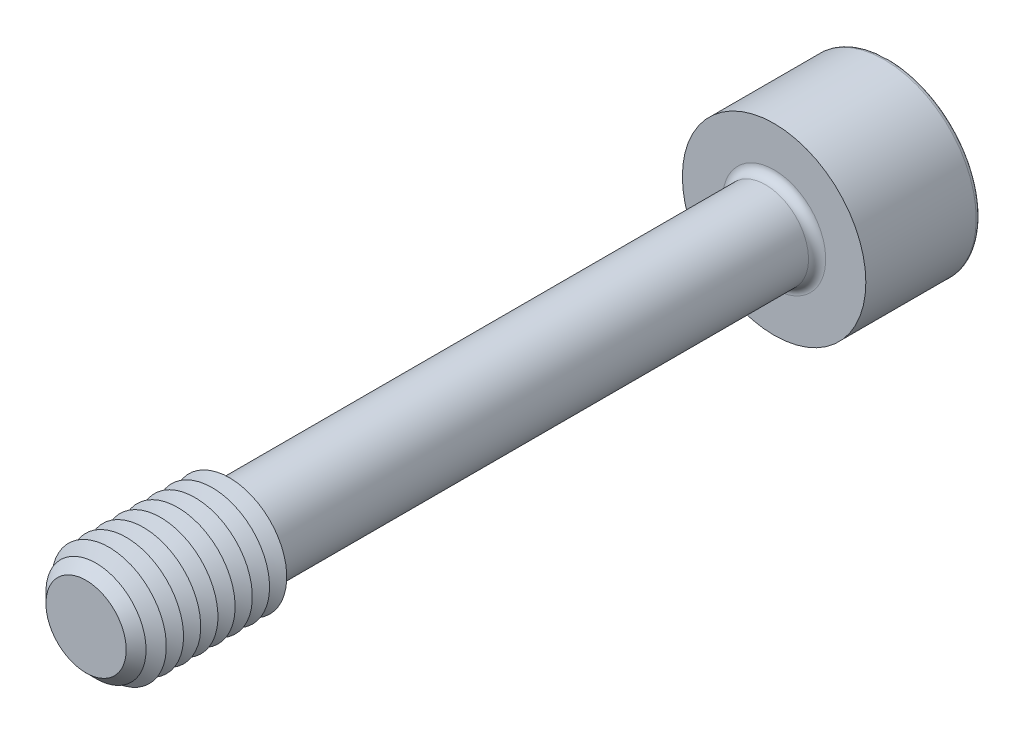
ISO-10303-21;
HEADER;
FILE_DESCRIPTION(('STEP AP214'),'2;1');
FILE_NAME('part.step','',(''),(''),'','','');
FILE_SCHEMA(('AUTOMOTIVE_DESIGN { 1 0 10303 214 1 1 1 1 }'));
ENDSEC;
DATA;
#1=APPLICATION_CONTEXT('core data for automotive mechanical design processes');
#2=APPLICATION_PROTOCOL_DEFINITION('international standard','automotive_design',2000,#1);
#3=PRODUCT_CONTEXT('',#1,'mechanical');
#4=PRODUCT('Part','Part','',(#3));
#5=PRODUCT_RELATED_PRODUCT_CATEGORY('part','',(#4));
#6=PRODUCT_DEFINITION_FORMATION('','',#4);
#7=PRODUCT_DEFINITION_CONTEXT('part definition',#1,'design');
#8=PRODUCT_DEFINITION('design','',#6,#7);
#9=PRODUCT_DEFINITION_SHAPE('','',#8);
#10=(LENGTH_UNIT() NAMED_UNIT(*) SI_UNIT(.MILLI.,.METRE.));
#11=(NAMED_UNIT(*) PLANE_ANGLE_UNIT() SI_UNIT($,.RADIAN.));
#12=(NAMED_UNIT(*) SI_UNIT($,.STERADIAN.) SOLID_ANGLE_UNIT());
#13=UNCERTAINTY_MEASURE_WITH_UNIT(LENGTH_MEASURE(1.E-05),#10,'distance_accuracy_value','');
#14=(GEOMETRIC_REPRESENTATION_CONTEXT(3) GLOBAL_UNCERTAINTY_ASSIGNED_CONTEXT((#13)) GLOBAL_UNIT_ASSIGNED_CONTEXT((#10,
#11,#12)) REPRESENTATION_CONTEXT('',''));
#15=CARTESIAN_POINT('',(0.,0.,0.));
#16=DIRECTION('',(0.,0.,1.));
#17=DIRECTION('',(1.,0.,0.));
#18=AXIS2_PLACEMENT_3D('',#15,#16,#17);
#19=CARTESIAN_POINT('',(-2.3094010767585,-4.,-32.));
#20=DIRECTION('',(0.,0.,1.));
#21=DIRECTION('',(1.,0.,0.));
#22=AXIS2_PLACEMENT_3D('',#19,#20,#21);
#23=PLANE('',#22);
#24=DIRECTION('',(1.,0.,0.));
#25=VECTOR('',#24,1.);
#26=CARTESIAN_POINT('',(-2.3094010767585,-4.,-32.));
#27=LINE('',#26,#25);
#28=CARTESIAN_POINT('',(0.,-4.,-32.));
#29=VERTEX_POINT('',#28);
#30=CARTESIAN_POINT('',(2.3094010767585,-4.,-32.));
#31=VERTEX_POINT('',#30);
#32=EDGE_CURVE('E762',#29,#31,#27,.T.);
#33=ORIENTED_EDGE('',*,*,#32,.F.);
#34=CARTESIAN_POINT('',(0.,0.,-32.));
#35=DIRECTION('',(0.,0.,1.));
#36=DIRECTION('',(0.,-1.,0.));
#37=AXIS2_PLACEMENT_3D('',#34,#35,#36);
#38=CIRCLE('',#37,4.);
#39=CARTESIAN_POINT('',(3.46410161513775,-2.,-32.));
#40=VERTEX_POINT('',#39);
#41=EDGE_CURVE('E53',#29,#40,#38,.T.);
#42=ORIENTED_EDGE('',*,*,#41,.T.);
#43=DIRECTION('',(0.5,0.866025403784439,0.));
#44=VECTOR('',#43,1.);
#45=CARTESIAN_POINT('',(2.3094010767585,-4.,-32.));
#46=LINE('',#45,#44);
#47=EDGE_CURVE('E747',#31,#40,#46,.T.);
#48=ORIENTED_EDGE('',*,*,#47,.F.);
#49=EDGE_LOOP('',(#33,#42,#48));
#50=FACE_BOUND('',#49,.T.);
#51=ADVANCED_FACE('F41',(#50),#23,.F.);
#52=CARTESIAN_POINT('',(4.618802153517,0.,-32.));
#53=VERTEX_POINT('',#52);
#54=EDGE_CURVE('E759',#40,#53,#46,.T.);
#55=ORIENTED_EDGE('',*,*,#54,.F.);
#56=CARTESIAN_POINT('',(3.46410161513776,2.,-32.));
#57=VERTEX_POINT('',#56);
#58=EDGE_CURVE('E11',#40,#57,#38,.T.);
#59=ORIENTED_EDGE('',*,*,#58,.T.);
#60=DIRECTION('',(-0.5,0.866025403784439,0.));
#61=VECTOR('',#60,1.);
#62=CARTESIAN_POINT('',(4.618802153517,0.,-32.));
#63=LINE('',#62,#61);
#64=EDGE_CURVE('E746',#53,#57,#63,.T.);
#65=ORIENTED_EDGE('',*,*,#64,.F.);
#66=EDGE_LOOP('',(#55,#59,#65));
#67=FACE_BOUND('',#66,.T.);
#68=ADVANCED_FACE('F133',(#67),#23,.F.);
#69=CARTESIAN_POINT('',(2.3094010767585,4.,-32.));
#70=VERTEX_POINT('',#69);
#71=EDGE_CURVE('E741',#57,#70,#63,.T.);
#72=ORIENTED_EDGE('',*,*,#71,.F.);
#73=CARTESIAN_POINT('',(0.,4.,-32.));
#74=VERTEX_POINT('',#73);
#75=EDGE_CURVE('E51',#57,#74,#38,.T.);
#76=ORIENTED_EDGE('',*,*,#75,.T.);
#77=DIRECTION('',(-1.,0.,0.));
#78=VECTOR('',#77,1.);
#79=CARTESIAN_POINT('',(2.3094010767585,4.,-32.));
#80=LINE('',#79,#78);
#81=EDGE_CURVE('E177',#70,#74,#80,.T.);
#82=ORIENTED_EDGE('',*,*,#81,.F.);
#83=EDGE_LOOP('',(#72,#76,#82));
#84=FACE_BOUND('',#83,.T.);
#85=ADVANCED_FACE('F139',(#84),#23,.F.);
#86=CARTESIAN_POINT('',(-2.3094010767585,4.,-32.));
#87=VERTEX_POINT('',#86);
#88=EDGE_CURVE('E752',#74,#87,#80,.T.);
#89=ORIENTED_EDGE('',*,*,#88,.F.);
#90=CARTESIAN_POINT('',(-3.46410161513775,2.,-32.));
#91=VERTEX_POINT('',#90);
#92=EDGE_CURVE('E265',#74,#91,#38,.T.);
#93=ORIENTED_EDGE('',*,*,#92,.T.);
#94=DIRECTION('',(-0.500000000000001,-0.866025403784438,0.));
#95=VECTOR('',#94,1.);
#96=CARTESIAN_POINT('',(-2.3094010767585,4.,-32.));
#97=LINE('',#96,#95);
#98=EDGE_CURVE('E176',#87,#91,#97,.T.);
#99=ORIENTED_EDGE('',*,*,#98,.F.);
#100=EDGE_LOOP('',(#89,#93,#99));
#101=FACE_BOUND('',#100,.T.);
#102=ADVANCED_FACE('F157',(#101),#23,.F.);
#103=CARTESIAN_POINT('',(-4.61880215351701,0.,-32.));
#104=VERTEX_POINT('',#103);
#105=EDGE_CURVE('E170',#91,#104,#97,.T.);
#106=ORIENTED_EDGE('',*,*,#105,.F.);
#107=CARTESIAN_POINT('',(-3.46410161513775,-2.,-32.));
#108=VERTEX_POINT('',#107);
#109=EDGE_CURVE('E172',#91,#108,#38,.T.);
#110=ORIENTED_EDGE('',*,*,#109,.T.);
#111=DIRECTION('',(0.5,-0.866025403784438,0.));
#112=VECTOR('',#111,1.);
#113=CARTESIAN_POINT('',(-4.61880215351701,0.,-32.));
#114=LINE('',#113,#112);
#115=EDGE_CURVE('E174',#104,#108,#114,.T.);
#116=ORIENTED_EDGE('',*,*,#115,.F.);
#117=EDGE_LOOP('',(#106,#110,#116));
#118=FACE_BOUND('',#117,.T.);
#119=ADVANCED_FACE('F146',(#118),#23,.F.);
#120=CARTESIAN_POINT('',(0.,0.,-40.));
#121=DIRECTION('',(0.,0.,-1.));
#122=DIRECTION('',(-1.,0.,0.));
#123=AXIS2_PLACEMENT_3D('',#120,#121,#122);
#124=PLANE('',#123);
#125=CARTESIAN_POINT('',(0.,0.,-40.));
#126=DIRECTION('',(0.,0.,-1.));
#127=DIRECTION('',(-1.,0.,0.));
#128=AXIS2_PLACEMENT_3D('',#125,#126,#127);
#129=CIRCLE('',#128,7.625);
#130=CARTESIAN_POINT('',(-7.625,0.,-40.));
#131=VERTEX_POINT('',#130);
#132=EDGE_CURVE('E251',#131,#131,#129,.T.);
#133=ORIENTED_EDGE('',*,*,#132,.T.);
#134=EDGE_LOOP('',(#133));
#135=FACE_BOUND('',#134,.T.);
#136=DIRECTION('',(-0.500000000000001,-0.866025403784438,0.));
#137=VECTOR('',#136,1.);
#138=CARTESIAN_POINT('',(-2.3094010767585,4.,-40.));
#139=LINE('',#138,#137);
#140=CARTESIAN_POINT('',(-2.3094010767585,4.,-40.));
#141=VERTEX_POINT('',#140);
#142=CARTESIAN_POINT('',(-4.61880215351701,0.,-40.));
#143=VERTEX_POINT('',#142);
#144=EDGE_CURVE('E212',#141,#143,#139,.T.);
#145=ORIENTED_EDGE('',*,*,#144,.T.);
#146=DIRECTION('',(0.5,-0.866025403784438,0.));
#147=VECTOR('',#146,1.);
#148=CARTESIAN_POINT('',(-4.61880215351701,0.,-40.));
#149=LINE('',#148,#147);
#150=CARTESIAN_POINT('',(-2.3094010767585,-4.,-40.));
#151=VERTEX_POINT('',#150);
#152=EDGE_CURVE('E67',#143,#151,#149,.T.);
#153=ORIENTED_EDGE('',*,*,#152,.T.);
#154=DIRECTION('',(1.,0.,0.));
#155=VECTOR('',#154,1.);
#156=CARTESIAN_POINT('',(-2.3094010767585,-4.,-40.));
#157=LINE('',#156,#155);
#158=CARTESIAN_POINT('',(2.3094010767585,-4.,-40.));
#159=VERTEX_POINT('',#158);
#160=EDGE_CURVE('E196',#151,#159,#157,.T.);
#161=ORIENTED_EDGE('',*,*,#160,.T.);
#162=DIRECTION('',(0.5,0.866025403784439,0.));
#163=VECTOR('',#162,1.);
#164=CARTESIAN_POINT('',(2.3094010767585,-4.,-40.));
#165=LINE('',#164,#163);
#166=CARTESIAN_POINT('',(4.618802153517,0.,-40.));
#167=VERTEX_POINT('',#166);
#168=EDGE_CURVE('E200',#159,#167,#165,.T.);
#169=ORIENTED_EDGE('',*,*,#168,.T.);
#170=DIRECTION('',(-0.5,0.866025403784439,0.));
#171=VECTOR('',#170,1.);
#172=CARTESIAN_POINT('',(4.618802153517,0.,-40.));
#173=LINE('',#172,#171);
#174=CARTESIAN_POINT('',(2.3094010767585,4.,-40.));
#175=VERTEX_POINT('',#174);
#176=EDGE_CURVE('E204',#167,#175,#173,.T.);
#177=ORIENTED_EDGE('',*,*,#176,.T.);
#178=DIRECTION('',(-1.,0.,0.));
#179=VECTOR('',#178,1.);
#180=CARTESIAN_POINT('',(2.3094010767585,4.,-40.));
#181=LINE('',#180,#179);
#182=EDGE_CURVE('E208',#175,#141,#181,.T.);
#183=ORIENTED_EDGE('',*,*,#182,.T.);
#184=EDGE_LOOP('',(#145,#153,#161,#169,#177,#183));
#185=FACE_BOUND('',#184,.T.);
#186=ADVANCED_FACE('F156',(#135,#185),#124,.T.);
#187=CARTESIAN_POINT('',(0.,0.,30.));
#188=DIRECTION('',(0.,0.,-1.));
#189=DIRECTION('',(-1.,0.,0.));
#190=AXIS2_PLACEMENT_3D('',#187,#188,#189);
#191=CYLINDRICAL_SURFACE('',#190,3.75);
#192=CARTESIAN_POINT('',(0.,0.,-29.25));
#193=DIRECTION('',(0.,0.,-1.));
#194=DIRECTION('',(-1.,0.,0.));
#195=AXIS2_PLACEMENT_3D('',#192,#193,#194);
#196=CIRCLE('',#195,3.75);
#197=CARTESIAN_POINT('',(-3.75,0.,-29.25));
#198=VERTEX_POINT('',#197);
#199=EDGE_CURVE('E247',#198,#198,#196,.F.);
#200=ORIENTED_EDGE('',*,*,#199,.T.);
#201=EDGE_LOOP('',(#200));
#202=FACE_BOUND('',#201,.T.);
#203=CARTESIAN_POINT('',(0.,0.,16.778312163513));
#204=DIRECTION('',(0.,0.,-1.));
#205=DIRECTION('',(0.,1.,0.));
#206=AXIS2_PLACEMENT_3D('',#203,#204,#205);
#207=CIRCLE('',#206,3.75);
#208=CARTESIAN_POINT('',(0.,3.75,16.778312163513));
#209=VERTEX_POINT('',#208);
#210=EDGE_CURVE('E235',#209,#209,#207,.T.);
#211=ORIENTED_EDGE('',*,*,#210,.T.);
#212=EDGE_LOOP('',(#211));
#213=FACE_BOUND('',#212,.T.);
#214=ADVANCED_FACE('F163',(#202,#213),#191,.T.);
#215=CARTESIAN_POINT('',(0.,0.,16.778312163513));
#216=DIRECTION('',(0.,0.,1.));
#217=DIRECTION('',(0.,-1.,0.));
#218=AXIS2_PLACEMENT_3D('',#215,#216,#217);
#219=CONICAL_SURFACE('',#218,3.75,1.0471975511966);
#220=CARTESIAN_POINT('',(0.,0.,17.5));
#221=DIRECTION('',(0.,0.,-1.));
#222=DIRECTION('',(-1.,0.,0.));
#223=AXIS2_PLACEMENT_3D('',#220,#221,#222);
#224=CIRCLE('',#223,5.);
#225=CARTESIAN_POINT('',(-5.,0.,17.5));
#226=VERTEX_POINT('',#225);
#227=EDGE_CURVE('E269',#226,#226,#224,.T.);
#228=ORIENTED_EDGE('',*,*,#227,.T.);
#229=EDGE_LOOP('',(#228));
#230=FACE_BOUND('',#229,.T.);
#231=ORIENTED_EDGE('',*,*,#210,.F.);
#232=EDGE_LOOP('',(#231));
#233=FACE_BOUND('',#232,.T.);
#234=ADVANCED_FACE('F510',(#230,#233),#219,.T.);
#235=CARTESIAN_POINT('',(0.,0.,-30.));
#236=DIRECTION('',(0.,0.,-1.));
#237=DIRECTION('',(-1.,0.,0.));
#238=AXIS2_PLACEMENT_3D('',#235,#236,#237);
#239=PLANE('',#238);
#240=CARTESIAN_POINT('',(0.,0.,-30.));
#241=DIRECTION('',(0.,0.,-1.));
#242=DIRECTION('',(-1.,0.,0.));
#243=AXIS2_PLACEMENT_3D('',#240,#241,#242);
#244=CIRCLE('',#243,4.5);
#245=CARTESIAN_POINT('',(-4.5,0.,-30.));
#246=VERTEX_POINT('',#245);
#247=EDGE_CURVE('E243',#246,#246,#244,.T.);
#248=ORIENTED_EDGE('',*,*,#247,.T.);
#249=EDGE_LOOP('',(#248));
#250=FACE_BOUND('',#249,.T.);
#251=CARTESIAN_POINT('',(0.,0.,-30.));
#252=DIRECTION('',(0.,0.,-1.));
#253=DIRECTION('',(-1.,0.,0.));
#254=AXIS2_PLACEMENT_3D('',#251,#252,#253);
#255=CIRCLE('',#254,8.);
#256=CARTESIAN_POINT('',(-8.,0.,-30.));
#257=VERTEX_POINT('',#256);
#258=EDGE_CURVE('E231',#257,#257,#255,.T.);
#259=ORIENTED_EDGE('',*,*,#258,.F.);
#260=EDGE_LOOP('',(#259));
#261=FACE_BOUND('',#260,.T.);
#262=ADVANCED_FACE('F503',(#250,#261),#239,.F.);
#263=CARTESIAN_POINT('',(0.,0.,-40.));
#264=DIRECTION('',(0.,0.,1.));
#265=DIRECTION('',(1.,0.,0.));
#266=AXIS2_PLACEMENT_3D('',#263,#264,#265);
#267=CYLINDRICAL_SURFACE('',#266,8.);
#268=CARTESIAN_POINT('',(0.,0.,-39.625));
#269=DIRECTION('',(0.,0.,-1.));
#270=DIRECTION('',(-1.,0.,0.));
#271=AXIS2_PLACEMENT_3D('',#268,#269,#270);
#272=CIRCLE('',#271,8.);
#273=CARTESIAN_POINT('',(-8.,0.,-39.625));
#274=VERTEX_POINT('',#273);
#275=EDGE_CURVE('E254',#274,#274,#272,.F.);
#276=ORIENTED_EDGE('',*,*,#275,.T.);
#277=EDGE_LOOP('',(#276));
#278=FACE_BOUND('',#277,.T.);
#279=ORIENTED_EDGE('',*,*,#258,.T.);
#280=EDGE_LOOP('',(#279));
#281=FACE_BOUND('',#280,.T.);
#282=ADVANCED_FACE('F509',(#278,#281),#267,.T.);
#283=CARTESIAN_POINT('',(-4.61880215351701,0.,-32.));
#284=DIRECTION('',(0.866025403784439,0.5,0.));
#285=DIRECTION('',(-0.5,0.866025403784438,0.));
#286=AXIS2_PLACEMENT_3D('',#283,#284,#285);
#287=PLANE('',#286);
#288=ORIENTED_EDGE('',*,*,#152,.F.);
#289=DIRECTION('',(0.,0.,-1.));
#290=VECTOR('',#289,1.);
#291=CARTESIAN_POINT('',(-4.61880215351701,0.,-32.));
#292=LINE('',#291,#290);
#293=EDGE_CURVE('E186',#104,#143,#292,.T.);
#294=ORIENTED_EDGE('',*,*,#293,.F.);
#295=ORIENTED_EDGE('',*,*,#115,.T.);
#296=CARTESIAN_POINT('',(-2.3094010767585,-4.,-32.));
#297=VERTEX_POINT('',#296);
#298=EDGE_CURVE('E215',#108,#297,#114,.T.);
#299=ORIENTED_EDGE('',*,*,#298,.T.);
#300=DIRECTION('',(0.,0.,-1.));
#301=VECTOR('',#300,1.);
#302=CARTESIAN_POINT('',(-2.3094010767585,-4.,-32.));
#303=LINE('',#302,#301);
#304=EDGE_CURVE('E228',#297,#151,#303,.T.);
#305=ORIENTED_EDGE('',*,*,#304,.T.);
#306=EDGE_LOOP('',(#288,#294,#295,#299,#305));
#307=FACE_BOUND('',#306,.T.);
#308=ADVANCED_FACE('F521',(#307),#287,.T.);
#309=CARTESIAN_POINT('',(-2.3094010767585,-4.,-32.));
#310=DIRECTION('',(0.,1.,0.));
#311=DIRECTION('',(-1.,0.,0.));
#312=AXIS2_PLACEMENT_3D('',#309,#310,#311);
#313=PLANE('',#312);
#314=ORIENTED_EDGE('',*,*,#160,.F.);
#315=ORIENTED_EDGE('',*,*,#304,.F.);
#316=EDGE_CURVE('E760',#297,#29,#27,.T.);
#317=ORIENTED_EDGE('',*,*,#316,.T.);
#318=ORIENTED_EDGE('',*,*,#32,.T.);
#319=DIRECTION('',(0.,0.,-1.));
#320=VECTOR('',#319,1.);
#321=CARTESIAN_POINT('',(2.3094010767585,-4.,-32.));
#322=LINE('',#321,#320);
#323=EDGE_CURVE('E225',#31,#159,#322,.T.);
#324=ORIENTED_EDGE('',*,*,#323,.T.);
#325=EDGE_LOOP('',(#314,#315,#317,#318,#324));
#326=FACE_BOUND('',#325,.T.);
#327=ADVANCED_FACE('F537',(#326),#313,.T.);
#328=CARTESIAN_POINT('',(2.3094010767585,-4.,-32.));
#329=DIRECTION('',(-0.866025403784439,0.5,0.));
#330=DIRECTION('',(-0.5,-0.866025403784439,0.));
#331=AXIS2_PLACEMENT_3D('',#328,#329,#330);
#332=PLANE('',#331);
#333=ORIENTED_EDGE('',*,*,#168,.F.);
#334=ORIENTED_EDGE('',*,*,#323,.F.);
#335=ORIENTED_EDGE('',*,*,#47,.T.);
#336=ORIENTED_EDGE('',*,*,#54,.T.);
#337=DIRECTION('',(0.,0.,-1.));
#338=VECTOR('',#337,1.);
#339=CARTESIAN_POINT('',(4.618802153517,0.,-32.));
#340=LINE('',#339,#338);
#341=EDGE_CURVE('E222',#53,#167,#340,.T.);
#342=ORIENTED_EDGE('',*,*,#341,.T.);
#343=EDGE_LOOP('',(#333,#334,#335,#336,#342));
#344=FACE_BOUND('',#343,.T.);
#345=ADVANCED_FACE('F547',(#344),#332,.T.);
#346=CARTESIAN_POINT('',(4.618802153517,0.,-32.));
#347=DIRECTION('',(-0.866025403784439,-0.5,0.));
#348=DIRECTION('',(0.5,-0.866025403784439,0.));
#349=AXIS2_PLACEMENT_3D('',#346,#347,#348);
#350=PLANE('',#349);
#351=ORIENTED_EDGE('',*,*,#176,.F.);
#352=ORIENTED_EDGE('',*,*,#341,.F.);
#353=ORIENTED_EDGE('',*,*,#64,.T.);
#354=ORIENTED_EDGE('',*,*,#71,.T.);
#355=DIRECTION('',(0.,0.,-1.));
#356=VECTOR('',#355,1.);
#357=CARTESIAN_POINT('',(2.3094010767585,4.,-32.));
#358=LINE('',#357,#356);
#359=EDGE_CURVE('E219',#70,#175,#358,.T.);
#360=ORIENTED_EDGE('',*,*,#359,.T.);
#361=EDGE_LOOP('',(#351,#352,#353,#354,#360));
#362=FACE_BOUND('',#361,.T.);
#363=ADVANCED_FACE('F557',(#362),#350,.T.);
#364=CARTESIAN_POINT('',(2.3094010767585,4.,-32.));
#365=DIRECTION('',(0.,-1.,0.));
#366=DIRECTION('',(0.,0.,-1.));
#367=AXIS2_PLACEMENT_3D('',#364,#365,#366);
#368=PLANE('',#367);
#369=ORIENTED_EDGE('',*,*,#182,.F.);
#370=ORIENTED_EDGE('',*,*,#359,.F.);
#371=ORIENTED_EDGE('',*,*,#81,.T.);
#372=ORIENTED_EDGE('',*,*,#88,.T.);
#373=DIRECTION('',(0.,0.,-1.));
#374=VECTOR('',#373,1.);
#375=CARTESIAN_POINT('',(-2.3094010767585,4.,-32.));
#376=LINE('',#375,#374);
#377=EDGE_CURVE('E182',#87,#141,#376,.T.);
#378=ORIENTED_EDGE('',*,*,#377,.T.);
#379=EDGE_LOOP('',(#369,#370,#371,#372,#378));
#380=FACE_BOUND('',#379,.T.);
#381=ADVANCED_FACE('F152',(#380),#368,.T.);
#382=CARTESIAN_POINT('',(-2.3094010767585,4.,-32.));
#383=DIRECTION('',(0.866025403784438,-0.500000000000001,0.));
#384=DIRECTION('',(0.500000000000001,0.866025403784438,0.));
#385=AXIS2_PLACEMENT_3D('',#382,#383,#384);
#386=PLANE('',#385);
#387=ORIENTED_EDGE('',*,*,#144,.F.);
#388=ORIENTED_EDGE('',*,*,#377,.F.);
#389=ORIENTED_EDGE('',*,*,#98,.T.);
#390=ORIENTED_EDGE('',*,*,#105,.T.);
#391=ORIENTED_EDGE('',*,*,#293,.T.);
#392=EDGE_LOOP('',(#387,#388,#389,#390,#391));
#393=FACE_BOUND('',#392,.T.);
#394=ADVANCED_FACE('F144',(#393),#386,.T.);
#395=ORIENTED_EDGE('',*,*,#298,.F.);
#396=EDGE_CURVE('E257',#108,#29,#38,.T.);
#397=ORIENTED_EDGE('',*,*,#396,.T.);
#398=ORIENTED_EDGE('',*,*,#316,.F.);
#399=EDGE_LOOP('',(#395,#397,#398));
#400=FACE_BOUND('',#399,.T.);
#401=ADVANCED_FACE('F135',(#400),#23,.F.);
#402=CARTESIAN_POINT('',(0.,0.,-29.25));
#403=DIRECTION('',(0.,0.,-1.));
#404=DIRECTION('',(-1.,0.,0.));
#405=AXIS2_PLACEMENT_3D('',#402,#403,#404);
#406=TOROIDAL_SURFACE('',#405,4.5,0.75);
#407=ORIENTED_EDGE('',*,*,#199,.F.);
#408=EDGE_LOOP('',(#407));
#409=FACE_BOUND('',#408,.T.);
#410=ORIENTED_EDGE('',*,*,#247,.F.);
#411=EDGE_LOOP('',(#410));
#412=FACE_BOUND('',#411,.T.);
#413=ADVANCED_FACE('F129',(#409,#412),#406,.F.);
#414=CARTESIAN_POINT('',(0.,0.,-39.625));
#415=DIRECTION('',(0.,0.,-1.));
#416=DIRECTION('',(-1.,0.,0.));
#417=AXIS2_PLACEMENT_3D('',#414,#415,#416);
#418=TOROIDAL_SURFACE('',#417,7.625,0.375);
#419=ORIENTED_EDGE('',*,*,#275,.F.);
#420=EDGE_LOOP('',(#419));
#421=FACE_BOUND('',#420,.T.);
#422=ORIENTED_EDGE('',*,*,#132,.F.);
#423=EDGE_LOOP('',(#422));
#424=FACE_BOUND('',#423,.T.);
#425=ADVANCED_FACE('F43',(#421,#424),#418,.T.);
#426=CARTESIAN_POINT('',(0.,0.,-29.6905989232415));
#427=DIRECTION('',(0.,0.,-1.));
#428=DIRECTION('',(0.,1.,0.));
#429=AXIS2_PLACEMENT_3D('',#426,#427,#428);
#430=CONICAL_SURFACE('',#429,0.,1.0471975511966);
#431=ORIENTED_EDGE('',*,*,#41,.F.);
#432=ORIENTED_EDGE('',*,*,#396,.F.);
#433=ORIENTED_EDGE('',*,*,#109,.F.);
#434=ORIENTED_EDGE('',*,*,#92,.F.);
#435=ORIENTED_EDGE('',*,*,#75,.F.);
#436=ORIENTED_EDGE('',*,*,#58,.F.);
#437=EDGE_LOOP('',(#431,#432,#433,#434,#435,#436));
#438=FACE_BOUND('',#437,.T.);
#439=CARTESIAN_POINT('',(0.,0.,-29.6905989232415));
#440=VERTEX_POINT('',#439);
#441=VERTEX_LOOP('',#440);
#442=FACE_BOUND('',#441,.T.);
#443=ADVANCED_FACE('F118',(#438,#442),#430,.F.);
#444=CARTESIAN_POINT('',(0.,0.,18.25));
#445=DIRECTION('',(0.,0.,-1.));
#446=DIRECTION('',(-1.,0.,0.));
#447=AXIS2_PLACEMENT_3D('',#444,#445,#446);
#448=CONICAL_SURFACE('',#447,3.70096189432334,1.0471975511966);
#449=ORIENTED_EDGE('',*,*,#227,.F.);
#450=EDGE_LOOP('',(#449));
#451=FACE_BOUND('',#450,.T.);
#452=CARTESIAN_POINT('',(0.,0.,18.25));
#453=DIRECTION('',(0.,0.,-1.));
#454=DIRECTION('',(-1.,0.,0.));
#455=AXIS2_PLACEMENT_3D('',#452,#453,#454);
#456=CIRCLE('',#455,3.70096189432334);
#457=CARTESIAN_POINT('',(-3.70096189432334,0.,18.25));
#458=VERTEX_POINT('',#457);
#459=EDGE_CURVE('E275',#458,#458,#456,.T.);
#460=ORIENTED_EDGE('',*,*,#459,.T.);
#461=EDGE_LOOP('',(#460));
#462=FACE_BOUND('',#461,.T.);
#463=ADVANCED_FACE('F120',(#451,#462),#448,.T.);
#464=CARTESIAN_POINT('',(0.,0.,19.));
#465=DIRECTION('',(0.,0.,1.));
#466=DIRECTION('',(1.,0.,0.));
#467=AXIS2_PLACEMENT_3D('',#464,#465,#466);
#468=CONICAL_SURFACE('',#467,5.,1.0471975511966);
#469=ORIENTED_EDGE('',*,*,#459,.F.);
#470=EDGE_LOOP('',(#469));
#471=FACE_BOUND('',#470,.T.);
#472=CARTESIAN_POINT('',(0.,0.,19.));
#473=DIRECTION('',(0.,0.,-1.));
#474=DIRECTION('',(-1.,0.,0.));
#475=AXIS2_PLACEMENT_3D('',#472,#473,#474);
#476=CIRCLE('',#475,5.);
#477=CARTESIAN_POINT('',(-5.,0.,19.));
#478=VERTEX_POINT('',#477);
#479=EDGE_CURVE('E282',#478,#478,#476,.T.);
#480=ORIENTED_EDGE('',*,*,#479,.T.);
#481=EDGE_LOOP('',(#480));
#482=FACE_BOUND('',#481,.T.);
#483=ADVANCED_FACE('F126',(#471,#482),#468,.T.);
#484=CARTESIAN_POINT('',(0.,0.,19.75));
#485=DIRECTION('',(0.,0.,-1.));
#486=DIRECTION('',(-1.,0.,0.));
#487=AXIS2_PLACEMENT_3D('',#484,#485,#486);
#488=CONICAL_SURFACE('',#487,3.70096189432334,1.0471975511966);
#489=ORIENTED_EDGE('',*,*,#479,.F.);
#490=EDGE_LOOP('',(#489));
#491=FACE_BOUND('',#490,.T.);
#492=CARTESIAN_POINT('',(0.,0.,19.75));
#493=DIRECTION('',(0.,0.,-1.));
#494=DIRECTION('',(-1.,0.,0.));
#495=AXIS2_PLACEMENT_3D('',#492,#493,#494);
#496=CIRCLE('',#495,3.70096189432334);
#497=CARTESIAN_POINT('',(-3.70096189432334,0.,19.75));
#498=VERTEX_POINT('',#497);
#499=EDGE_CURVE('E288',#498,#498,#496,.T.);
#500=ORIENTED_EDGE('',*,*,#499,.T.);
#501=EDGE_LOOP('',(#500));
#502=FACE_BOUND('',#501,.T.);
#503=ADVANCED_FACE('F397',(#491,#502),#488,.T.);
#504=CARTESIAN_POINT('',(0.,0.,20.5));
#505=DIRECTION('',(0.,0.,1.));
#506=DIRECTION('',(1.,0.,0.));
#507=AXIS2_PLACEMENT_3D('',#504,#505,#506);
#508=CONICAL_SURFACE('',#507,5.,1.0471975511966);
#509=ORIENTED_EDGE('',*,*,#499,.F.);
#510=EDGE_LOOP('',(#509));
#511=FACE_BOUND('',#510,.T.);
#512=CARTESIAN_POINT('',(0.,0.,20.5));
#513=DIRECTION('',(0.,0.,-1.));
#514=DIRECTION('',(-1.,0.,0.));
#515=AXIS2_PLACEMENT_3D('',#512,#513,#514);
#516=CIRCLE('',#515,5.);
#517=CARTESIAN_POINT('',(-5.,0.,20.5));
#518=VERTEX_POINT('',#517);
#519=EDGE_CURVE('E292',#518,#518,#516,.T.);
#520=ORIENTED_EDGE('',*,*,#519,.T.);
#521=EDGE_LOOP('',(#520));
#522=FACE_BOUND('',#521,.T.);
#523=ADVANCED_FACE('F393',(#511,#522),#508,.T.);
#524=CARTESIAN_POINT('',(0.,0.,21.25));
#525=DIRECTION('',(0.,0.,-1.));
#526=DIRECTION('',(-1.,0.,0.));
#527=AXIS2_PLACEMENT_3D('',#524,#525,#526);
#528=CONICAL_SURFACE('',#527,3.70096189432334,1.0471975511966);
#529=ORIENTED_EDGE('',*,*,#519,.F.);
#530=EDGE_LOOP('',(#529));
#531=FACE_BOUND('',#530,.T.);
#532=CARTESIAN_POINT('',(0.,0.,21.25));
#533=DIRECTION('',(0.,0.,-1.));
#534=DIRECTION('',(-1.,0.,0.));
#535=AXIS2_PLACEMENT_3D('',#532,#533,#534);
#536=CIRCLE('',#535,3.70096189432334);
#537=CARTESIAN_POINT('',(-3.70096189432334,0.,21.25));
#538=VERTEX_POINT('',#537);
#539=EDGE_CURVE('E296',#538,#538,#536,.T.);
#540=ORIENTED_EDGE('',*,*,#539,.T.);
#541=EDGE_LOOP('',(#540));
#542=FACE_BOUND('',#541,.T.);
#543=ADVANCED_FACE('F389',(#531,#542),#528,.T.);
#544=CARTESIAN_POINT('',(0.,0.,22.));
#545=DIRECTION('',(0.,0.,1.));
#546=DIRECTION('',(1.,0.,0.));
#547=AXIS2_PLACEMENT_3D('',#544,#545,#546);
#548=CONICAL_SURFACE('',#547,5.,1.0471975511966);
#549=ORIENTED_EDGE('',*,*,#539,.F.);
#550=EDGE_LOOP('',(#549));
#551=FACE_BOUND('',#550,.T.);
#552=CARTESIAN_POINT('',(0.,0.,22.));
#553=DIRECTION('',(0.,0.,-1.));
#554=DIRECTION('',(-1.,0.,0.));
#555=AXIS2_PLACEMENT_3D('',#552,#553,#554);
#556=CIRCLE('',#555,5.);
#557=CARTESIAN_POINT('',(-5.,0.,22.));
#558=VERTEX_POINT('',#557);
#559=EDGE_CURVE('E300',#558,#558,#556,.T.);
#560=ORIENTED_EDGE('',*,*,#559,.T.);
#561=EDGE_LOOP('',(#560));
#562=FACE_BOUND('',#561,.T.);
#563=ADVANCED_FACE('F385',(#551,#562),#548,.T.);
#564=CARTESIAN_POINT('',(0.,0.,22.75));
#565=DIRECTION('',(0.,0.,-1.));
#566=DIRECTION('',(-1.,0.,0.));
#567=AXIS2_PLACEMENT_3D('',#564,#565,#566);
#568=CONICAL_SURFACE('',#567,3.70096189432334,1.0471975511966);
#569=ORIENTED_EDGE('',*,*,#559,.F.);
#570=EDGE_LOOP('',(#569));
#571=FACE_BOUND('',#570,.T.);
#572=CARTESIAN_POINT('',(0.,0.,22.75));
#573=DIRECTION('',(0.,0.,-1.));
#574=DIRECTION('',(-1.,0.,0.));
#575=AXIS2_PLACEMENT_3D('',#572,#573,#574);
#576=CIRCLE('',#575,3.70096189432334);
#577=CARTESIAN_POINT('',(-3.70096189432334,0.,22.75));
#578=VERTEX_POINT('',#577);
#579=EDGE_CURVE('E303',#578,#578,#576,.T.);
#580=ORIENTED_EDGE('',*,*,#579,.T.);
#581=EDGE_LOOP('',(#580));
#582=FACE_BOUND('',#581,.T.);
#583=ADVANCED_FACE('F381',(#571,#582),#568,.T.);
#584=CARTESIAN_POINT('',(0.,0.,23.5));
#585=DIRECTION('',(0.,0.,1.));
#586=DIRECTION('',(1.,0.,0.));
#587=AXIS2_PLACEMENT_3D('',#584,#585,#586);
#588=CONICAL_SURFACE('',#587,5.,1.0471975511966);
#589=ORIENTED_EDGE('',*,*,#579,.F.);
#590=EDGE_LOOP('',(#589));
#591=FACE_BOUND('',#590,.T.);
#592=CARTESIAN_POINT('',(0.,0.,23.5));
#593=DIRECTION('',(0.,0.,-1.));
#594=DIRECTION('',(-1.,0.,0.));
#595=AXIS2_PLACEMENT_3D('',#592,#593,#594);
#596=CIRCLE('',#595,5.);
#597=CARTESIAN_POINT('',(-5.,0.,23.5));
#598=VERTEX_POINT('',#597);
#599=EDGE_CURVE('E306',#598,#598,#596,.T.);
#600=ORIENTED_EDGE('',*,*,#599,.T.);
#601=EDGE_LOOP('',(#600));
#602=FACE_BOUND('',#601,.T.);
#603=ADVANCED_FACE('F377',(#591,#602),#588,.T.);
#604=CARTESIAN_POINT('',(0.,0.,24.25));
#605=DIRECTION('',(0.,0.,-1.));
#606=DIRECTION('',(-1.,0.,0.));
#607=AXIS2_PLACEMENT_3D('',#604,#605,#606);
#608=CONICAL_SURFACE('',#607,3.70096189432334,1.0471975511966);
#609=ORIENTED_EDGE('',*,*,#599,.F.);
#610=EDGE_LOOP('',(#609));
#611=FACE_BOUND('',#610,.T.);
#612=CARTESIAN_POINT('',(0.,0.,24.25));
#613=DIRECTION('',(0.,0.,-1.));
#614=DIRECTION('',(-1.,0.,0.));
#615=AXIS2_PLACEMENT_3D('',#612,#613,#614);
#616=CIRCLE('',#615,3.70096189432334);
#617=CARTESIAN_POINT('',(-3.70096189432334,0.,24.25));
#618=VERTEX_POINT('',#617);
#619=EDGE_CURVE('E310',#618,#618,#616,.T.);
#620=ORIENTED_EDGE('',*,*,#619,.T.);
#621=EDGE_LOOP('',(#620));
#622=FACE_BOUND('',#621,.T.);
#623=ADVANCED_FACE('F373',(#611,#622),#608,.T.);
#624=CARTESIAN_POINT('',(0.,0.,25.));
#625=DIRECTION('',(0.,0.,1.));
#626=DIRECTION('',(1.,0.,0.));
#627=AXIS2_PLACEMENT_3D('',#624,#625,#626);
#628=CONICAL_SURFACE('',#627,5.,1.0471975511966);
#629=ORIENTED_EDGE('',*,*,#619,.F.);
#630=EDGE_LOOP('',(#629));
#631=FACE_BOUND('',#630,.T.);
#632=CARTESIAN_POINT('',(0.,0.,25.));
#633=DIRECTION('',(0.,0.,-1.));
#634=DIRECTION('',(-1.,0.,0.));
#635=AXIS2_PLACEMENT_3D('',#632,#633,#634);
#636=CIRCLE('',#635,5.);
#637=CARTESIAN_POINT('',(-5.,0.,25.));
#638=VERTEX_POINT('',#637);
#639=EDGE_CURVE('E314',#638,#638,#636,.T.);
#640=ORIENTED_EDGE('',*,*,#639,.T.);
#641=EDGE_LOOP('',(#640));
#642=FACE_BOUND('',#641,.T.);
#643=ADVANCED_FACE('F369',(#631,#642),#628,.T.);
#644=CARTESIAN_POINT('',(0.,0.,25.75));
#645=DIRECTION('',(0.,0.,-1.));
#646=DIRECTION('',(-1.,0.,0.));
#647=AXIS2_PLACEMENT_3D('',#644,#645,#646);
#648=CONICAL_SURFACE('',#647,3.70096189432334,1.0471975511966);
#649=ORIENTED_EDGE('',*,*,#639,.F.);
#650=EDGE_LOOP('',(#649));
#651=FACE_BOUND('',#650,.T.);
#652=CARTESIAN_POINT('',(0.,0.,25.75));
#653=DIRECTION('',(0.,0.,-1.));
#654=DIRECTION('',(-1.,0.,0.));
#655=AXIS2_PLACEMENT_3D('',#652,#653,#654);
#656=CIRCLE('',#655,3.70096189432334);
#657=CARTESIAN_POINT('',(-3.70096189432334,0.,25.75));
#658=VERTEX_POINT('',#657);
#659=EDGE_CURVE('E318',#658,#658,#656,.T.);
#660=ORIENTED_EDGE('',*,*,#659,.T.);
#661=EDGE_LOOP('',(#660));
#662=FACE_BOUND('',#661,.T.);
#663=ADVANCED_FACE('F365',(#651,#662),#648,.T.);
#664=CARTESIAN_POINT('',(0.,0.,26.5));
#665=DIRECTION('',(0.,0.,1.));
#666=DIRECTION('',(1.,0.,0.));
#667=AXIS2_PLACEMENT_3D('',#664,#665,#666);
#668=CONICAL_SURFACE('',#667,5.,1.0471975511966);
#669=ORIENTED_EDGE('',*,*,#659,.F.);
#670=EDGE_LOOP('',(#669));
#671=FACE_BOUND('',#670,.T.);
#672=CARTESIAN_POINT('',(0.,0.,26.5));
#673=DIRECTION('',(0.,0.,-1.));
#674=DIRECTION('',(-1.,0.,0.));
#675=AXIS2_PLACEMENT_3D('',#672,#673,#674);
#676=CIRCLE('',#675,5.);
#677=CARTESIAN_POINT('',(-5.,0.,26.5));
#678=VERTEX_POINT('',#677);
#679=EDGE_CURVE('E322',#678,#678,#676,.T.);
#680=ORIENTED_EDGE('',*,*,#679,.T.);
#681=EDGE_LOOP('',(#680));
#682=FACE_BOUND('',#681,.T.);
#683=ADVANCED_FACE('F361',(#671,#682),#668,.T.);
#684=CARTESIAN_POINT('',(0.,0.,27.25));
#685=DIRECTION('',(0.,0.,-1.));
#686=DIRECTION('',(-1.,0.,0.));
#687=AXIS2_PLACEMENT_3D('',#684,#685,#686);
#688=CONICAL_SURFACE('',#687,3.70096189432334,1.0471975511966);
#689=ORIENTED_EDGE('',*,*,#679,.F.);
#690=EDGE_LOOP('',(#689));
#691=FACE_BOUND('',#690,.T.);
#692=CARTESIAN_POINT('',(0.,0.,27.25));
#693=DIRECTION('',(0.,0.,-1.));
#694=DIRECTION('',(-1.,0.,0.));
#695=AXIS2_PLACEMENT_3D('',#692,#693,#694);
#696=CIRCLE('',#695,3.70096189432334);
#697=CARTESIAN_POINT('',(-3.70096189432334,0.,27.25));
#698=VERTEX_POINT('',#697);
#699=EDGE_CURVE('E326',#698,#698,#696,.T.);
#700=ORIENTED_EDGE('',*,*,#699,.T.);
#701=EDGE_LOOP('',(#700));
#702=FACE_BOUND('',#701,.T.);
#703=ADVANCED_FACE('F357',(#691,#702),#688,.T.);
#704=CARTESIAN_POINT('',(0.,0.,28.));
#705=DIRECTION('',(0.,0.,1.));
#706=DIRECTION('',(1.,0.,0.));
#707=AXIS2_PLACEMENT_3D('',#704,#705,#706);
#708=CONICAL_SURFACE('',#707,5.,1.0471975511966);
#709=ORIENTED_EDGE('',*,*,#699,.F.);
#710=EDGE_LOOP('',(#709));
#711=FACE_BOUND('',#710,.T.);
#712=CARTESIAN_POINT('',(0.,0.,28.));
#713=DIRECTION('',(0.,0.,-1.));
#714=DIRECTION('',(-1.,0.,0.));
#715=AXIS2_PLACEMENT_3D('',#712,#713,#714);
#716=CIRCLE('',#715,5.);
#717=CARTESIAN_POINT('',(-5.,0.,28.));
#718=VERTEX_POINT('',#717);
#719=EDGE_CURVE('E329',#718,#718,#716,.T.);
#720=ORIENTED_EDGE('',*,*,#719,.T.);
#721=EDGE_LOOP('',(#720));
#722=FACE_BOUND('',#721,.T.);
#723=ADVANCED_FACE('F350',(#711,#722),#708,.T.);
#724=CARTESIAN_POINT('',(0.,0.,28.75));
#725=DIRECTION('',(0.,0.,-1.));
#726=DIRECTION('',(-1.,0.,0.));
#727=AXIS2_PLACEMENT_3D('',#724,#725,#726);
#728=CONICAL_SURFACE('',#727,3.70096189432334,1.0471975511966);
#729=ORIENTED_EDGE('',*,*,#719,.F.);
#730=EDGE_LOOP('',(#729));
#731=FACE_BOUND('',#730,.T.);
#732=CARTESIAN_POINT('',(0.,0.,28.75));
#733=DIRECTION('',(0.,0.,-1.));
#734=DIRECTION('',(-1.,0.,0.));
#735=AXIS2_PLACEMENT_3D('',#732,#733,#734);
#736=CIRCLE('',#735,3.70096189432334);
#737=CARTESIAN_POINT('',(-3.70096189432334,0.,28.75));
#738=VERTEX_POINT('',#737);
#739=EDGE_CURVE('E332',#738,#738,#736,.T.);
#740=ORIENTED_EDGE('',*,*,#739,.T.);
#741=EDGE_LOOP('',(#740));
#742=FACE_BOUND('',#741,.T.);
#743=ADVANCED_FACE('F336',(#731,#742),#728,.T.);
#744=CARTESIAN_POINT('',(0.,0.,29.5));
#745=DIRECTION('',(0.,0.,1.));
#746=DIRECTION('',(1.,0.,0.));
#747=AXIS2_PLACEMENT_3D('',#744,#745,#746);
#748=CONICAL_SURFACE('',#747,5.,1.0471975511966);
#749=CARTESIAN_POINT('',(0.,0.,29.1339745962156));
#750=DIRECTION('',(0.,0.,1.));
#751=DIRECTION('',(1.,0.,0.));
#752=AXIS2_PLACEMENT_3D('',#749,#750,#751);
#753=CIRCLE('',#752,4.36602540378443);
#754=CARTESIAN_POINT('',(4.36602540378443,0.,29.1339745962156));
#755=VERTEX_POINT('',#754);
#756=EDGE_CURVE('E45',#755,#755,#753,.F.);
#757=ORIENTED_EDGE('',*,*,#756,.T.);
#758=EDGE_LOOP('',(#757));
#759=FACE_BOUND('',#758,.T.);
#760=ORIENTED_EDGE('',*,*,#739,.F.);
#761=EDGE_LOOP('',(#760));
#762=FACE_BOUND('',#761,.T.);
#763=ADVANCED_FACE('F338',(#759,#762),#748,.T.);
#764=CARTESIAN_POINT('',(0.,0.,30.));
#765=DIRECTION('',(0.,0.,1.));
#766=DIRECTION('',(1.,0.,0.));
#767=AXIS2_PLACEMENT_3D('',#764,#765,#766);
#768=PLANE('',#767);
#769=CARTESIAN_POINT('',(0.,0.,30.));
#770=DIRECTION('',(0.,0.,1.));
#771=DIRECTION('',(1.,0.,0.));
#772=AXIS2_PLACEMENT_3D('',#769,#770,#771);
#773=CIRCLE('',#772,3.49999999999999);
#774=CARTESIAN_POINT('',(3.49999999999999,0.,30.));
#775=VERTEX_POINT('',#774);
#776=EDGE_CURVE('E239',#775,#775,#773,.T.);
#777=ORIENTED_EDGE('',*,*,#776,.T.);
#778=EDGE_LOOP('',(#777));
#779=FACE_BOUND('',#778,.T.);
#780=ADVANCED_FACE('F340',(#779),#768,.T.);
#781=CARTESIAN_POINT('',(0.,0.,28.5));
#782=DIRECTION('',(0.,0.,-1.));
#783=DIRECTION('',(0.,1.,0.));
#784=AXIS2_PLACEMENT_3D('',#781,#782,#783);
#785=CONICAL_SURFACE('',#784,5.,0.785398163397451);
#786=ORIENTED_EDGE('',*,*,#756,.F.);
#787=EDGE_LOOP('',(#786));
#788=FACE_BOUND('',#787,.T.);
#789=ORIENTED_EDGE('',*,*,#776,.F.);
#790=EDGE_LOOP('',(#789));
#791=FACE_BOUND('',#790,.T.);
#792=ADVANCED_FACE('F347',(#788,#791),#785,.T.);
#793=CLOSED_SHELL('',(#51,#68,#85,#102,#119,#186,#214,#234,#262,#282,#308,#327,#345,#363,#381,
#394,#401,#413,#425,#443,#463,#483,#503,#523,#543,#563,#583,#603,#623,#643,#663,#683,#703,#723,
#743,#763,#780,#792));
#794=MANIFOLD_SOLID_BREP('B2',#793);
#795=ADVANCED_BREP_SHAPE_REPRESENTATION('',(#18,#794),#14);
#796=SHAPE_DEFINITION_REPRESENTATION(#9,#795);
ENDSEC;
END-ISO-10303-21;
